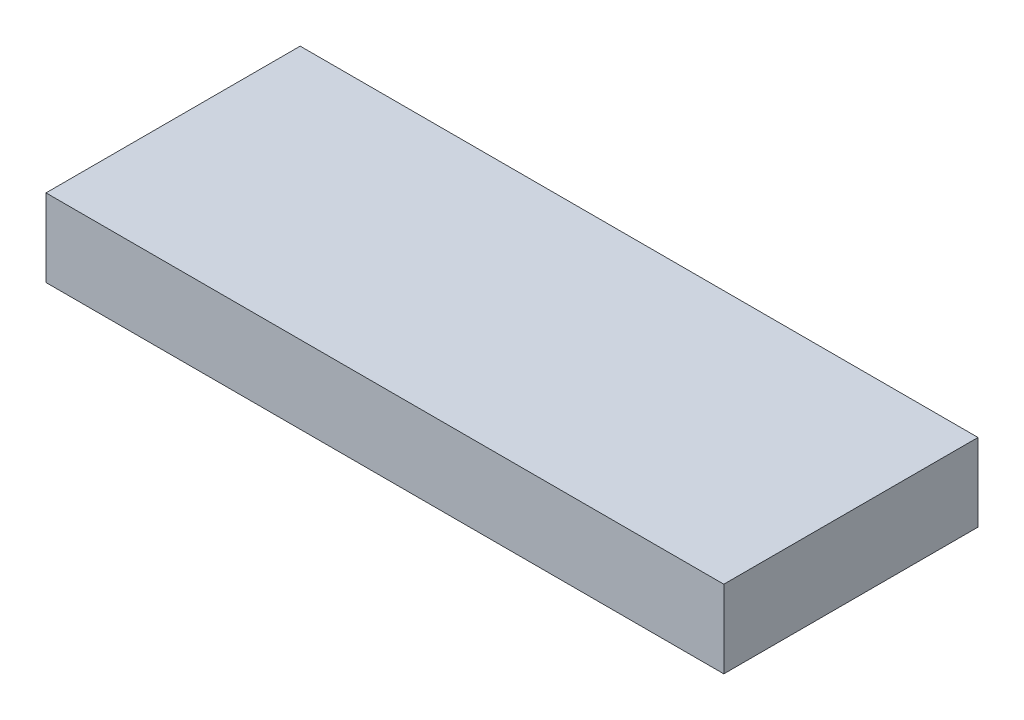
ISO-10303-21;
HEADER;
FILE_DESCRIPTION(('STEP AP214'),'2;1');
FILE_NAME('part.step','',(''),(''),'','','');
FILE_SCHEMA(('AUTOMOTIVE_DESIGN { 1 0 10303 214 1 1 1 1 }'));
ENDSEC;
DATA;
#1=APPLICATION_CONTEXT('core data for automotive mechanical design processes');
#2=APPLICATION_PROTOCOL_DEFINITION('international standard','automotive_design',2000,#1);
#3=PRODUCT_CONTEXT('',#1,'mechanical');
#4=PRODUCT('Part','Part','',(#3));
#5=PRODUCT_RELATED_PRODUCT_CATEGORY('part','',(#4));
#6=PRODUCT_DEFINITION_FORMATION('','',#4);
#7=PRODUCT_DEFINITION_CONTEXT('part definition',#1,'design');
#8=PRODUCT_DEFINITION('design','',#6,#7);
#9=PRODUCT_DEFINITION_SHAPE('','',#8);
#10=(LENGTH_UNIT() NAMED_UNIT(*) SI_UNIT(.MILLI.,.METRE.));
#11=(NAMED_UNIT(*) PLANE_ANGLE_UNIT() SI_UNIT($,.RADIAN.));
#12=(NAMED_UNIT(*) SI_UNIT($,.STERADIAN.) SOLID_ANGLE_UNIT());
#13=UNCERTAINTY_MEASURE_WITH_UNIT(LENGTH_MEASURE(1.E-05),#10,'distance_accuracy_value','');
#14=(GEOMETRIC_REPRESENTATION_CONTEXT(3) GLOBAL_UNCERTAINTY_ASSIGNED_CONTEXT((#13)) GLOBAL_UNIT_ASSIGNED_CONTEXT((#10,
#11,#12)) REPRESENTATION_CONTEXT('',''));
#15=CARTESIAN_POINT('',(0.,0.,0.));
#16=DIRECTION('',(0.,0.,1.));
#17=DIRECTION('',(1.,0.,0.));
#18=AXIS2_PLACEMENT_3D('',#15,#16,#17);
#19=CARTESIAN_POINT('',(-76.2,-8.73125,-57.15));
#20=DIRECTION('',(1.,0.,0.));
#21=DIRECTION('',(0.,0.,-1.));
#22=AXIS2_PLACEMENT_3D('',#19,#20,#21);
#23=PLANE('',#22);
#24=DIRECTION('',(0.,1.,0.));
#25=VECTOR('',#24,1.);
#26=CARTESIAN_POINT('',(-76.2,-8.73125,0.));
#27=LINE('',#26,#25);
#28=CARTESIAN_POINT('',(-76.2,-8.73125,0.));
#29=VERTEX_POINT('',#28);
#30=CARTESIAN_POINT('',(-76.2,8.73125,0.));
#31=VERTEX_POINT('',#30);
#32=EDGE_CURVE('E95',#29,#31,#27,.T.);
#33=ORIENTED_EDGE('',*,*,#32,.T.);
#34=DIRECTION('',(0.,0.,1.));
#35=VECTOR('',#34,1.);
#36=CARTESIAN_POINT('',(-76.2,8.73125,-57.15));
#37=LINE('',#36,#35);
#38=CARTESIAN_POINT('',(-76.2,8.73125,-57.15));
#39=VERTEX_POINT('',#38);
#40=EDGE_CURVE('E11',#39,#31,#37,.T.);
#41=ORIENTED_EDGE('',*,*,#40,.F.);
#42=DIRECTION('',(0.,1.,0.));
#43=VECTOR('',#42,1.);
#44=CARTESIAN_POINT('',(-76.2,-8.73125,-57.15));
#45=LINE('',#44,#43);
#46=CARTESIAN_POINT('',(-76.2,-8.73125,-57.15));
#47=VERTEX_POINT('',#46);
#48=EDGE_CURVE('E81',#47,#39,#45,.T.);
#49=ORIENTED_EDGE('',*,*,#48,.F.);
#50=DIRECTION('',(0.,0.,1.));
#51=VECTOR('',#50,1.);
#52=CARTESIAN_POINT('',(-76.2,-8.73125,-57.15));
#53=LINE('',#52,#51);
#54=EDGE_CURVE('E48',#47,#29,#53,.T.);
#55=ORIENTED_EDGE('',*,*,#54,.T.);
#56=EDGE_LOOP('',(#33,#41,#49,#55));
#57=FACE_BOUND('',#56,.T.);
#58=ADVANCED_FACE('F32',(#57),#23,.F.);
#59=CARTESIAN_POINT('',(-76.2,8.73125,-57.15));
#60=DIRECTION('',(0.,-1.,0.));
#61=DIRECTION('',(0.,0.,-1.));
#62=AXIS2_PLACEMENT_3D('',#59,#60,#61);
#63=PLANE('',#62);
#64=DIRECTION('',(1.,0.,0.));
#65=VECTOR('',#64,1.);
#66=CARTESIAN_POINT('',(-76.2,8.73125,0.));
#67=LINE('',#66,#65);
#68=CARTESIAN_POINT('',(76.2,8.73125,0.));
#69=VERTEX_POINT('',#68);
#70=EDGE_CURVE('E86',#31,#69,#67,.T.);
#71=ORIENTED_EDGE('',*,*,#70,.T.);
#72=DIRECTION('',(0.,0.,1.));
#73=VECTOR('',#72,1.);
#74=CARTESIAN_POINT('',(76.2,8.73125,-57.15));
#75=LINE('',#74,#73);
#76=CARTESIAN_POINT('',(76.2,8.73125,-57.15));
#77=VERTEX_POINT('',#76);
#78=EDGE_CURVE('E40',#77,#69,#75,.T.);
#79=ORIENTED_EDGE('',*,*,#78,.F.);
#80=DIRECTION('',(1.,0.,0.));
#81=VECTOR('',#80,1.);
#82=CARTESIAN_POINT('',(-76.2,8.73125,-57.15));
#83=LINE('',#82,#81);
#84=EDGE_CURVE('E73',#39,#77,#83,.T.);
#85=ORIENTED_EDGE('',*,*,#84,.F.);
#86=ORIENTED_EDGE('',*,*,#40,.T.);
#87=EDGE_LOOP('',(#71,#79,#85,#86));
#88=FACE_BOUND('',#87,.T.);
#89=ADVANCED_FACE('F85',(#88),#63,.F.);
#90=CARTESIAN_POINT('',(76.2,-8.73125,-57.15));
#91=DIRECTION('',(1.,0.,0.));
#92=DIRECTION('',(0.,0.,-1.));
#93=AXIS2_PLACEMENT_3D('',#90,#91,#92);
#94=PLANE('',#93);
#95=DIRECTION('',(0.,1.,0.));
#96=VECTOR('',#95,1.);
#97=CARTESIAN_POINT('',(76.2,-8.73125,0.));
#98=LINE('',#97,#96);
#99=CARTESIAN_POINT('',(76.2,-8.73125,0.));
#100=VERTEX_POINT('',#99);
#101=EDGE_CURVE('E98',#100,#69,#98,.T.);
#102=ORIENTED_EDGE('',*,*,#101,.F.);
#103=DIRECTION('',(0.,0.,1.));
#104=VECTOR('',#103,1.);
#105=CARTESIAN_POINT('',(76.2,-8.73125,-57.15));
#106=LINE('',#105,#104);
#107=CARTESIAN_POINT('',(76.2,-8.73125,-57.15));
#108=VERTEX_POINT('',#107);
#109=EDGE_CURVE('E62',#108,#100,#106,.T.);
#110=ORIENTED_EDGE('',*,*,#109,.F.);
#111=DIRECTION('',(0.,1.,0.));
#112=VECTOR('',#111,1.);
#113=CARTESIAN_POINT('',(76.2,-8.73125,-57.15));
#114=LINE('',#113,#112);
#115=EDGE_CURVE('E80',#108,#77,#114,.T.);
#116=ORIENTED_EDGE('',*,*,#115,.T.);
#117=ORIENTED_EDGE('',*,*,#78,.T.);
#118=EDGE_LOOP('',(#102,#110,#116,#117));
#119=FACE_BOUND('',#118,.T.);
#120=ADVANCED_FACE('F89',(#119),#94,.T.);
#121=CARTESIAN_POINT('',(-76.2,-8.73125,-57.15));
#122=DIRECTION('',(0.,-1.,0.));
#123=DIRECTION('',(0.,0.,-1.));
#124=AXIS2_PLACEMENT_3D('',#121,#122,#123);
#125=PLANE('',#124);
#126=DIRECTION('',(1.,0.,0.));
#127=VECTOR('',#126,1.);
#128=CARTESIAN_POINT('',(-76.2,-8.73125,0.));
#129=LINE('',#128,#127);
#130=EDGE_CURVE('E100',#29,#100,#129,.T.);
#131=ORIENTED_EDGE('',*,*,#130,.F.);
#132=ORIENTED_EDGE('',*,*,#54,.F.);
#133=DIRECTION('',(1.,0.,0.));
#134=VECTOR('',#133,1.);
#135=CARTESIAN_POINT('',(-76.2,-8.73125,-57.15));
#136=LINE('',#135,#134);
#137=EDGE_CURVE('E90',#47,#108,#136,.T.);
#138=ORIENTED_EDGE('',*,*,#137,.T.);
#139=ORIENTED_EDGE('',*,*,#109,.T.);
#140=EDGE_LOOP('',(#131,#132,#138,#139));
#141=FACE_BOUND('',#140,.T.);
#142=ADVANCED_FACE('F106',(#141),#125,.T.);
#143=CARTESIAN_POINT('',(0.,0.,-57.15));
#144=DIRECTION('',(0.,0.,-1.));
#145=DIRECTION('',(-1.,0.,0.));
#146=AXIS2_PLACEMENT_3D('',#143,#144,#145);
#147=PLANE('',#146);
#148=ORIENTED_EDGE('',*,*,#48,.T.);
#149=ORIENTED_EDGE('',*,*,#84,.T.);
#150=ORIENTED_EDGE('',*,*,#115,.F.);
#151=ORIENTED_EDGE('',*,*,#137,.F.);
#152=EDGE_LOOP('',(#148,#149,#150,#151));
#153=FACE_BOUND('',#152,.T.);
#154=ADVANCED_FACE('F77',(#153),#147,.T.);
#155=CARTESIAN_POINT('',(0.,0.,0.));
#156=DIRECTION('',(0.,0.,-1.));
#157=DIRECTION('',(-1.,0.,0.));
#158=AXIS2_PLACEMENT_3D('',#155,#156,#157);
#159=PLANE('',#158);
#160=ORIENTED_EDGE('',*,*,#32,.F.);
#161=ORIENTED_EDGE('',*,*,#130,.T.);
#162=ORIENTED_EDGE('',*,*,#101,.T.);
#163=ORIENTED_EDGE('',*,*,#70,.F.);
#164=EDGE_LOOP('',(#160,#161,#162,#163));
#165=FACE_BOUND('',#164,.T.);
#166=ADVANCED_FACE('F105',(#165),#159,.F.);
#167=CLOSED_SHELL('',(#58,#89,#120,#142,#154,#166));
#168=MANIFOLD_SOLID_BREP('B2',#167);
#169=ADVANCED_BREP_SHAPE_REPRESENTATION('',(#18,#168),#14);
#170=SHAPE_DEFINITION_REPRESENTATION(#9,#169);
ENDSEC;
END-ISO-10303-21;
